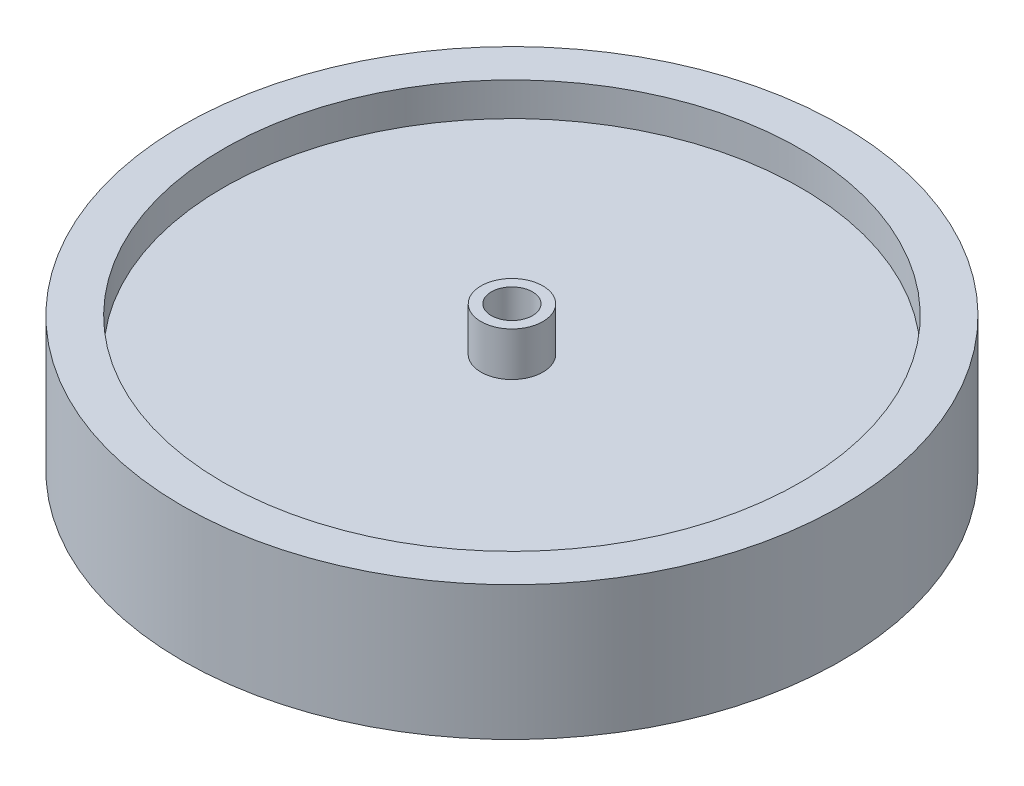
from build123d import *

# Parameters (mm, degrees)
CUT_EXTRUDE1_START = -5.1562
SKETCH4_R          = 44.45
SKETCH4_R_2        = 4.7625
CUT_EXTRUDE1_DEPTH = 5.1562
SKETCH5_R          = 44.45
SKETCH5_R_2        = 4.7625
CUT_EXTRUDE2_DEPTH = 5.1562
SKETCH6_R          = 3.175
BORE_DEPTH         = 76.600396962


with BuildPart() as part:
    # Sketch3 → Revolve1 (revolve)
    with BuildSketch(Plane.XY, mode=Mode.PRIVATE) as revolve1_sk:
        Polygon((0, -4.923653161), (4.7625, -4.923653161), (4.7625, -6.511153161), (50.7365, -6.511153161), (50.7365, -27.148653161), (4.7625, -27.148653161), (4.7625, -28.736153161), (0, -28.736153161), align=None)
    revolve(revolve1_sk.sketch.rotate(Axis((0, 28.736153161, 0), (0, -1, 0)), 90), axis=Axis((0, 28.736153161, 0), (0, -1, 0)))

    # Sketch4 → Cut-Extrude1 (cut)
    with BuildSketch(Plane(origin=(0, -6.511153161, 0), x_dir=(-1, 0, 0), z_dir=(0, 1, 0)).offset(CUT_EXTRUDE1_START)):
        with Locations(Location((0, 0, 0), (0, 0, 90))):
            Circle(SKETCH4_R)
        with Locations(Location((0, 0, 0), (0, 0, 90))):
            Circle(SKETCH4_R_2, mode=Mode.SUBTRACT)
    extrude(amount=CUT_EXTRUDE1_DEPTH, mode=Mode.SUBTRACT)

    # Sketch5 → Cut-Extrude2 (cut)
    with BuildSketch(Plane.XZ.offset(27.148653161)):
        with Locations(Location((0, 0, 0), (0, 0, 90))):
            Circle(SKETCH5_R)
        with Locations(Location((0, 0, 0), (0, 0, 90))):
            Circle(SKETCH5_R_2, mode=Mode.SUBTRACT)
    extrude(amount=-CUT_EXTRUDE2_DEPTH, mode=Mode.SUBTRACT)

    # Sketch6 → Bore (cut, through all)
    with BuildSketch(Plane.XZ.offset(28.736153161)):
        with Locations(Location((0, 0, 0), (0, 0, 270))):
            Circle(SKETCH6_R)
    extrude(amount=-BORE_DEPTH, mode=Mode.SUBTRACT)


solid = part.part
